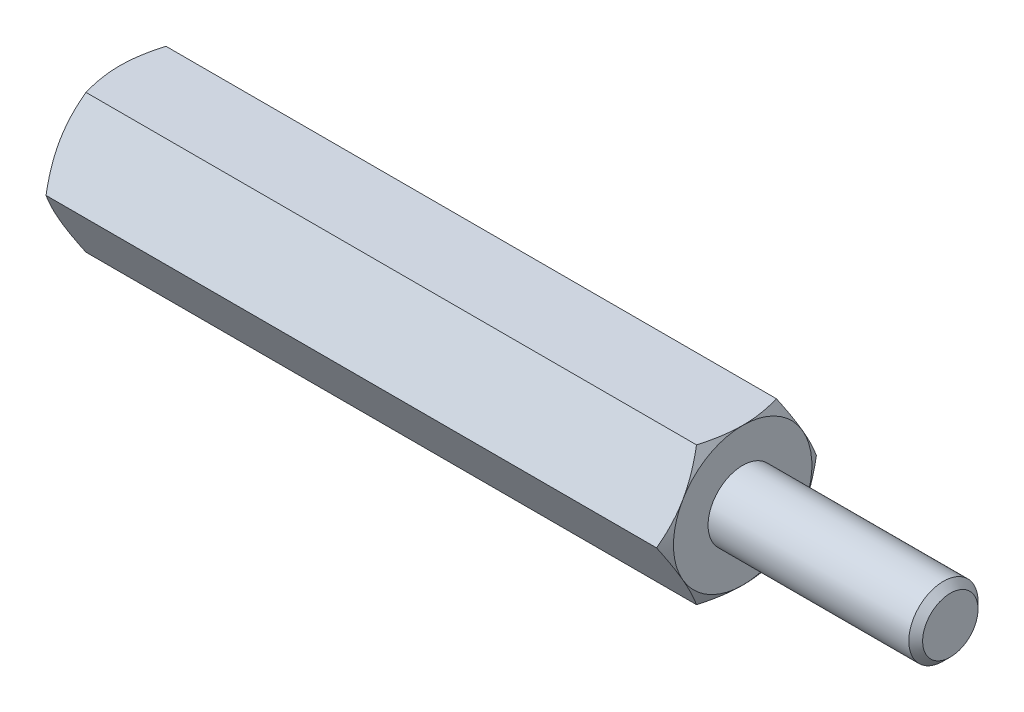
ISO-10303-21;
HEADER;
FILE_DESCRIPTION(('STEP AP214'),'2;1');
FILE_NAME('part.step','',(''),(''),'','','');
FILE_SCHEMA(('AUTOMOTIVE_DESIGN { 1 0 10303 214 1 1 1 1 }'));
ENDSEC;
DATA;
#1=APPLICATION_CONTEXT('core data for automotive mechanical design processes');
#2=APPLICATION_PROTOCOL_DEFINITION('international standard','automotive_design',2000,#1);
#3=PRODUCT_CONTEXT('',#1,'mechanical');
#4=PRODUCT('Part','Part','',(#3));
#5=PRODUCT_RELATED_PRODUCT_CATEGORY('part','',(#4));
#6=PRODUCT_DEFINITION_FORMATION('','',#4);
#7=PRODUCT_DEFINITION_CONTEXT('part definition',#1,'design');
#8=PRODUCT_DEFINITION('design','',#6,#7);
#9=PRODUCT_DEFINITION_SHAPE('','',#8);
#10=(LENGTH_UNIT() NAMED_UNIT(*) SI_UNIT(.MILLI.,.METRE.));
#11=(NAMED_UNIT(*) PLANE_ANGLE_UNIT() SI_UNIT($,.RADIAN.));
#12=(NAMED_UNIT(*) SI_UNIT($,.STERADIAN.) SOLID_ANGLE_UNIT());
#13=UNCERTAINTY_MEASURE_WITH_UNIT(LENGTH_MEASURE(1.E-05),#10,'distance_accuracy_value','');
#14=(GEOMETRIC_REPRESENTATION_CONTEXT(3) GLOBAL_UNCERTAINTY_ASSIGNED_CONTEXT((#13)) GLOBAL_UNIT_ASSIGNED_CONTEXT((#10,
#11,#12)) REPRESENTATION_CONTEXT('',''));
#15=CARTESIAN_POINT('',(0.,0.,0.));
#16=DIRECTION('',(0.,0.,1.));
#17=DIRECTION('',(1.,0.,0.));
#18=AXIS2_PLACEMENT_3D('',#15,#16,#17);
#19=CARTESIAN_POINT('',(9.,2.,-1.15470053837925));
#20=DIRECTION('',(1.,0.,0.));
#21=DIRECTION('',(0.,0.,-1.));
#22=AXIS2_PLACEMENT_3D('',#19,#20,#21);
#23=PLANE('',#22);
#24=CARTESIAN_POINT('',(9.,0.,0.));
#25=DIRECTION('',(1.,0.,0.));
#26=DIRECTION('',(0.,0.,-1.));
#27=AXIS2_PLACEMENT_3D('',#24,#25,#26);
#28=CIRCLE('',#27,2.);
#29=CARTESIAN_POINT('',(9.,-1.,-1.73205080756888));
#30=VERTEX_POINT('',#29);
#31=CARTESIAN_POINT('',(9.,0.999999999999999,-1.73205080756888));
#32=VERTEX_POINT('',#31);
#33=EDGE_CURVE('E288',#30,#32,#28,.T.);
#34=ORIENTED_EDGE('',*,*,#33,.T.);
#35=CARTESIAN_POINT('',(9.,2.,0.));
#36=VERTEX_POINT('',#35);
#37=EDGE_CURVE('E53',#32,#36,#28,.T.);
#38=ORIENTED_EDGE('',*,*,#37,.T.);
#39=CARTESIAN_POINT('',(9.,0.999999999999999,1.73205080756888));
#40=VERTEX_POINT('',#39);
#41=EDGE_CURVE('E295',#36,#40,#28,.T.);
#42=ORIENTED_EDGE('',*,*,#41,.T.);
#43=CARTESIAN_POINT('',(9.,-1.,1.73205080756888));
#44=VERTEX_POINT('',#43);
#45=EDGE_CURVE('E301',#40,#44,#28,.T.);
#46=ORIENTED_EDGE('',*,*,#45,.T.);
#47=CARTESIAN_POINT('',(9.,0.,0.));
#48=DIRECTION('',(-1.,0.,0.));
#49=DIRECTION('',(0.,-1.,0.));
#50=AXIS2_PLACEMENT_3D('',#47,#48,#49);
#51=CIRCLE('',#50,2.);
#52=CARTESIAN_POINT('',(9.,-2.,0.));
#53=VERTEX_POINT('',#52);
#54=EDGE_CURVE('E193',#53,#44,#51,.T.);
#55=ORIENTED_EDGE('',*,*,#54,.F.);
#56=EDGE_CURVE('E61',#53,#30,#28,.T.);
#57=ORIENTED_EDGE('',*,*,#56,.T.);
#58=EDGE_LOOP('',(#34,#38,#42,#46,#55,#57));
#59=FACE_BOUND('',#58,.T.);
#60=CARTESIAN_POINT('',(9.,0.,0.));
#61=DIRECTION('',(1.,0.,0.));
#62=DIRECTION('',(0.,0.,-1.));
#63=AXIS2_PLACEMENT_3D('',#60,#61,#62);
#64=CIRCLE('',#63,1.);
#65=CARTESIAN_POINT('',(9.,0.,-1.));
#66=VERTEX_POINT('',#65);
#67=EDGE_CURVE('E323',#66,#66,#64,.T.);
#68=ORIENTED_EDGE('',*,*,#67,.F.);
#69=EDGE_LOOP('',(#68));
#70=FACE_BOUND('',#69,.T.);
#71=ADVANCED_FACE('F37',(#59,#70),#23,.T.);
#72=CARTESIAN_POINT('',(9.,0.,-2.3094010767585));
#73=DIRECTION('',(0.,-0.5,0.866025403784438));
#74=DIRECTION('',(0.,-0.866025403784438,-0.5));
#75=AXIS2_PLACEMENT_3D('',#72,#73,#74);
#76=PLANE('',#75);
#77=CARTESIAN_POINT('',(8.8213005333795,-0.000200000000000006,-2.30951654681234));
#78=CARTESIAN_POINT('',(8.85061046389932,0.0876912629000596,-2.25877250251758));
#79=CARTESIAN_POINT('',(8.87726714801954,0.176341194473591,-2.20759044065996));
#80=CARTESIAN_POINT('',(8.92379750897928,0.355176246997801,-2.10433997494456));
#81=CARTESIAN_POINT('',(8.94365472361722,0.445364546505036,-2.05226973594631));
#82=CARTESIAN_POINT('',(8.97456653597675,0.624623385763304,-1.94877459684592));
#83=CARTESIAN_POINT('',(8.98582684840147,0.713666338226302,-1.89736562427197));
#84=CARTESIAN_POINT('',(8.99927133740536,0.892171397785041,-1.79430568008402));
#85=CARTESIAN_POINT('',(9.00146664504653,0.981632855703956,-1.74265508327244));
#86=CARTESIAN_POINT('',(8.99690901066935,1.1488083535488,-1.64613626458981));
#87=CARTESIAN_POINT('',(8.99127512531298,1.22654737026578,-1.60125362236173));
#88=CARTESIAN_POINT('',(8.97341610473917,1.38151891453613,-1.51178075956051));
#89=CARTESIAN_POINT('',(8.96118486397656,1.4587509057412,-1.46719084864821));
#90=CARTESIAN_POINT('',(8.93060656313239,1.6140421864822,-1.37753338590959));
#91=CARTESIAN_POINT('',(8.91212983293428,1.69208181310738,-1.33247718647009));
#92=CARTESIAN_POINT('',(8.87019448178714,1.84699686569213,-1.24303693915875));
#93=CARTESIAN_POINT('',(8.84674571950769,1.92387427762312,-1.1986517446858));
#94=CARTESIAN_POINT('',(8.8213005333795,2.0002,-1.15458506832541));
#95=B_SPLINE_CURVE_WITH_KNOTS('',3,(#77,#78,#79,#80,#81,#82,#83,#84,#85,#86,#87,#88,#89,#90,#91,
#92,#93,#94),.UNSPECIFIED.,.F.,.F.,(4,2,2,2,2,2,2,2,4),(0.,0.317031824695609,0.634825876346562,
0.944753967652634,1.25430138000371,1.52387047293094,1.79368946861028,2.06949491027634,
2.34475850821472),.UNSPECIFIED.);
#96=CARTESIAN_POINT('',(8.82136720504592,0.,-2.3094010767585));
#97=VERTEX_POINT('',#96);
#98=EDGE_CURVE('E321',#97,#32,#95,.T.);
#99=ORIENTED_EDGE('',*,*,#98,.F.);
#100=DIRECTION('',(-1.,0.,0.));
#101=VECTOR('',#100,1.);
#102=CARTESIAN_POINT('',(9.,0.,-2.3094010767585));
#103=LINE('',#102,#101);
#104=CARTESIAN_POINT('',(-8.82136720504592,0.,-2.3094010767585));
#105=VERTEX_POINT('',#104);
#106=EDGE_CURVE('E264',#97,#105,#103,.T.);
#107=ORIENTED_EDGE('',*,*,#106,.T.);
#108=CARTESIAN_POINT('',(-8.8213005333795,2.0002,-1.15458506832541));
#109=CARTESIAN_POINT('',(-8.85061046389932,1.91230873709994,-1.20532911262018));
#110=CARTESIAN_POINT('',(-8.87726714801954,1.82365880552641,-1.2565111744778));
#111=CARTESIAN_POINT('',(-8.92379750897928,1.6448237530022,-1.35976164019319));
#112=CARTESIAN_POINT('',(-8.94365472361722,1.55463545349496,-1.41183187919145));
#113=CARTESIAN_POINT('',(-8.97456653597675,1.37537661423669,-1.51532701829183));
#114=CARTESIAN_POINT('',(-8.98582684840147,1.2863336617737,-1.56673599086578));
#115=CARTESIAN_POINT('',(-8.99927133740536,1.10782860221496,-1.66979593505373));
#116=CARTESIAN_POINT('',(-9.00146664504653,1.01836714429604,-1.72144653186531));
#117=CARTESIAN_POINT('',(-8.99690901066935,0.851191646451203,-1.81796535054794));
#118=CARTESIAN_POINT('',(-8.99127512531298,0.773452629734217,-1.86284799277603));
#119=CARTESIAN_POINT('',(-8.97341610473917,0.618481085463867,-1.95232085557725));
#120=CARTESIAN_POINT('',(-8.96118486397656,0.541249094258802,-1.99691076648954));
#121=CARTESIAN_POINT('',(-8.93060656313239,0.3859578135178,-2.08656822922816));
#122=CARTESIAN_POINT('',(-8.91212983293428,0.307918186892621,-2.13162442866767));
#123=CARTESIAN_POINT('',(-8.87019448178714,0.153003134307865,-2.221064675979));
#124=CARTESIAN_POINT('',(-8.84674571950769,0.0761257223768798,-2.26544987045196));
#125=CARTESIAN_POINT('',(-8.8213005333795,-0.000200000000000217,-2.30951654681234));
#126=B_SPLINE_CURVE_WITH_KNOTS('',3,(#108,#109,#110,#111,#112,#113,#114,#115,#116,#117,#118,
#119,#120,#121,#122,#123,#124,#125),.UNSPECIFIED.,.F.,.F.,(4,2,2,2,2,2,2,2,4),(0.,
0.317031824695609,0.634825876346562,0.944753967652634,1.25430138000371,1.52387047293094,
1.79368946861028,2.06949491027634,2.34475850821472),.UNSPECIFIED.);
#127=CARTESIAN_POINT('',(-9.,0.999999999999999,-1.73205080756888));
#128=VERTEX_POINT('',#127);
#129=EDGE_CURVE('E314',#128,#105,#126,.T.);
#130=ORIENTED_EDGE('',*,*,#129,.F.);
#131=CARTESIAN_POINT('',(-8.82136720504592,2.,-1.15470053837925));
#132=VERTEX_POINT('',#131);
#133=EDGE_CURVE('E399',#132,#128,#126,.T.);
#134=ORIENTED_EDGE('',*,*,#133,.F.);
#135=DIRECTION('',(-1.,0.,0.));
#136=VECTOR('',#135,1.);
#137=CARTESIAN_POINT('',(9.,2.,-1.15470053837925));
#138=LINE('',#137,#136);
#139=CARTESIAN_POINT('',(8.821367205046,2.,-1.15470053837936));
#140=VERTEX_POINT('',#139);
#141=EDGE_CURVE('E279',#140,#132,#138,.T.);
#142=ORIENTED_EDGE('',*,*,#141,.F.);
#143=EDGE_CURVE('E229',#32,#140,#95,.T.);
#144=ORIENTED_EDGE('',*,*,#143,.F.);
#145=EDGE_LOOP('',(#99,#107,#130,#134,#142,#144));
#146=FACE_BOUND('',#145,.T.);
#147=ADVANCED_FACE('F148',(#146),#76,.F.);
#148=CARTESIAN_POINT('',(9.,2.,-1.15470053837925));
#149=DIRECTION('',(0.,-1.,0.));
#150=DIRECTION('',(0.,0.,-1.));
#151=AXIS2_PLACEMENT_3D('',#148,#149,#150);
#152=PLANE('',#151);
#153=CARTESIAN_POINT('',(8.0041453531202,2.,-3.14239762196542));
#154=CARTESIAN_POINT('',(8.04685680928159,2.,-3.05468337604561));
#155=CARTESIAN_POINT('',(8.08917030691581,2.,-2.96677207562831));
#156=CARTESIAN_POINT('',(8.17277831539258,2.,-2.79045070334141));
#157=CARTESIAN_POINT('',(8.21407267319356,2.,-2.70204055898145));
#158=CARTESIAN_POINT('',(8.29561838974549,2.,-2.52418069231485));
#159=CARTESIAN_POINT('',(8.33586319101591,2.,-2.43472795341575));
#160=CARTESIAN_POINT('',(8.41475904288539,2.,-2.25512498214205));
#161=CARTESIAN_POINT('',(8.45341016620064,2.,-2.16497478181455));
#162=CARTESIAN_POINT('',(8.52996617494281,2.,-1.98078525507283));
#163=CARTESIAN_POINT('',(8.56780217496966,2.,-1.88671714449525));
#164=CARTESIAN_POINT('',(8.64070044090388,2.,-1.69751412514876));
#165=CARTESIAN_POINT('',(8.67576294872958,2.,-1.60237931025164));
#166=CARTESIAN_POINT('',(8.74223535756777,2.,-1.41102905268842));
#167=CARTESIAN_POINT('',(8.77365196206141,2.,-1.31481596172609));
#168=CARTESIAN_POINT('',(8.83184764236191,2.,-1.12101028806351));
#169=CARTESIAN_POINT('',(8.8586281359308,2.,-1.02341813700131));
#170=CARTESIAN_POINT('',(8.90615162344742,2.,-0.827336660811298));
#171=CARTESIAN_POINT('',(8.9269281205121,2.,-0.728855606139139));
#172=CARTESIAN_POINT('',(8.96129559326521,2.,-0.530628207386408));
#173=CARTESIAN_POINT('',(8.97488733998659,2.,-0.430882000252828));
#174=CARTESIAN_POINT('',(8.99362159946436,2.,-0.231937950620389));
#175=CARTESIAN_POINT('',(8.99887592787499,2.,-0.132750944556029));
#176=CARTESIAN_POINT('',(9.00079968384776,2.,0.0657049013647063));
#177=CARTESIAN_POINT('',(8.9974689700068,2.,0.164973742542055));
#178=CARTESIAN_POINT('',(8.97965125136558,2.,0.4006926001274));
#179=CARTESIAN_POINT('',(8.96138848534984,2.,0.536859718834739));
#180=CARTESIAN_POINT('',(8.91179958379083,2.,0.806792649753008));
#181=CARTESIAN_POINT('',(8.88046153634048,2.,0.9405561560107));
#182=CARTESIAN_POINT('',(8.80733694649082,2.,1.20849227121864));
#183=CARTESIAN_POINT('',(8.76532316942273,2.,1.34260127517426));
#184=CARTESIAN_POINT('',(8.69701155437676,2.,1.54188460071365));
#185=CARTESIAN_POINT('',(8.67336125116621,2.,1.60799390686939));
#186=CARTESIAN_POINT('',(8.62457310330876,2.,1.73966131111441));
#187=CARTESIAN_POINT('',(8.59943529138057,2.,1.80521942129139));
#188=CARTESIAN_POINT('',(8.53045244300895,2.,1.98014362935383));
#189=CARTESIAN_POINT('',(8.48548288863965,2.,2.08906517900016));
#190=CARTESIAN_POINT('',(8.39293953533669,2.,2.3058004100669));
#191=CARTESIAN_POINT('',(8.34536546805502,2.,2.41361397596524));
#192=CARTESIAN_POINT('',(8.24822629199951,2.,2.62838132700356));
#193=CARTESIAN_POINT('',(8.19866051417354,2.,2.7353348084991));
#194=CARTESIAN_POINT('',(8.09800140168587,2.,2.94852186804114));
#195=CARTESIAN_POINT('',(8.04690802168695,2.,3.05475542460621));
#196=CARTESIAN_POINT('',(7.89169615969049,2.,3.37291303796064));
#197=CARTESIAN_POINT('',(7.78579652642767,2.,3.58396705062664));
#198=CARTESIAN_POINT('',(7.57100981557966,2.,4.00448363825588));
#199=CARTESIAN_POINT('',(7.46212334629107,2.,4.21394652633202));
#200=CARTESIAN_POINT('',(7.25376773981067,2.,4.61000648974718));
#201=CARTESIAN_POINT('',(7.15450073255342,2.,4.79671008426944));
#202=CARTESIAN_POINT('',(6.95476413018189,2.,5.16948614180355));
#203=CARTESIAN_POINT('',(6.85429446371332,2.,5.35555856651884));
#204=CARTESIAN_POINT('',(6.6527937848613,2.,5.72660635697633));
#205=CARTESIAN_POINT('',(6.55176570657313,2.,5.9115833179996));
#206=CARTESIAN_POINT('',(6.34902395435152,2.,6.28114276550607));
#207=CARTESIAN_POINT('',(6.24731033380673,2.,6.46572528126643));
#208=CARTESIAN_POINT('',(6.14534707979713,2.,6.65016883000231));
#209=B_SPLINE_CURVE_WITH_KNOTS('',3,(#153,#154,#155,#156,#157,#158,#159,#160,#161,#162,#163,
#164,#165,#166,#167,#168,#169,#170,#171,#172,#173,#174,#175,#176,#177,#178,#179,#180,#181,#182,
#183,#184,#185,#186,#187,#188,#189,#190,#191,#192,#193,#194,#195,#196,#197,#198,#199,#200,#201,
#202,#203,#204,#205,#206,#207,#208),.UNSPECIFIED.,.F.,.F.,(4,2,2,2,2,2,2,2,2,2,2,2,2,2,2,2,2,2,
2,2,2,2,2,2,2,2,2,4),(0.,0.29268498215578,0.585413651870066,0.879667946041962,1.17390879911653,
1.47805164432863,1.78216793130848,2.08571589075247,2.38917085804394,2.690898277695,
2.99259331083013,3.29020694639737,3.58782548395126,3.99913738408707,4.41082482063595,
4.83214112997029,5.0427662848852,5.25338680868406,5.60685637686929,5.96036243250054,
6.31398824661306,6.66762456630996,7.37597688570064,8.08418599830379,8.71853756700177,
9.3529269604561,9.98522933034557,10.6174830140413),.UNSPECIFIED.);
#210=EDGE_CURVE('E227',#140,#36,#209,.T.);
#211=ORIENTED_EDGE('',*,*,#210,.F.);
#212=ORIENTED_EDGE('',*,*,#141,.T.);
#213=CARTESIAN_POINT('',(-8.0041453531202,2.,-3.14239762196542));
#214=CARTESIAN_POINT('',(-8.04685680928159,2.,-3.05468337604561));
#215=CARTESIAN_POINT('',(-8.08917030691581,2.,-2.96677207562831));
#216=CARTESIAN_POINT('',(-8.17277831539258,2.,-2.79045070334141));
#217=CARTESIAN_POINT('',(-8.21407267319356,2.,-2.70204055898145));
#218=CARTESIAN_POINT('',(-8.29561838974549,2.,-2.52418069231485));
#219=CARTESIAN_POINT('',(-8.33586319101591,2.,-2.43472795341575));
#220=CARTESIAN_POINT('',(-8.41475904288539,2.,-2.25512498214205));
#221=CARTESIAN_POINT('',(-8.45341016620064,2.,-2.16497478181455));
#222=CARTESIAN_POINT('',(-8.52996617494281,2.,-1.98078525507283));
#223=CARTESIAN_POINT('',(-8.56780217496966,2.,-1.88671714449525));
#224=CARTESIAN_POINT('',(-8.64070044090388,2.,-1.69751412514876));
#225=CARTESIAN_POINT('',(-8.67576294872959,2.,-1.60237931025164));
#226=CARTESIAN_POINT('',(-8.74223535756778,2.,-1.41102905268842));
#227=CARTESIAN_POINT('',(-8.77365196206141,2.,-1.31481596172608));
#228=CARTESIAN_POINT('',(-8.83184764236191,2.,-1.12101028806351));
#229=CARTESIAN_POINT('',(-8.8586281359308,2.,-1.02341813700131));
#230=CARTESIAN_POINT('',(-8.90615162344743,2.,-0.827336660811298));
#231=CARTESIAN_POINT('',(-8.9269281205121,2.,-0.728855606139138));
#232=CARTESIAN_POINT('',(-8.96129559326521,2.,-0.530628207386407));
#233=CARTESIAN_POINT('',(-8.97488733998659,2.,-0.430882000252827));
#234=CARTESIAN_POINT('',(-8.99362159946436,2.,-0.231937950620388));
#235=CARTESIAN_POINT('',(-8.99887592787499,2.,-0.132750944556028));
#236=CARTESIAN_POINT('',(-9.00079968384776,2.,0.065704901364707));
#237=CARTESIAN_POINT('',(-8.9974689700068,2.,0.164973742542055));
#238=CARTESIAN_POINT('',(-8.97965125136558,2.,0.400692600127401));
#239=CARTESIAN_POINT('',(-8.96138848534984,2.,0.536859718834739));
#240=CARTESIAN_POINT('',(-8.91179958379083,2.,0.806792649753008));
#241=CARTESIAN_POINT('',(-8.88046153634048,2.,0.9405561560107));
#242=CARTESIAN_POINT('',(-8.80733694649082,2.,1.20849227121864));
#243=CARTESIAN_POINT('',(-8.76532316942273,2.,1.34260127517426));
#244=CARTESIAN_POINT('',(-8.69701155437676,2.,1.54188460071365));
#245=CARTESIAN_POINT('',(-8.67336125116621,2.,1.6079939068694));
#246=CARTESIAN_POINT('',(-8.62457310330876,2.,1.73966131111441));
#247=CARTESIAN_POINT('',(-8.59943529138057,2.,1.80521942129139));
#248=CARTESIAN_POINT('',(-8.53045244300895,2.,1.98014362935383));
#249=CARTESIAN_POINT('',(-8.48548288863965,2.,2.08906517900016));
#250=CARTESIAN_POINT('',(-8.39293953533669,2.,2.3058004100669));
#251=CARTESIAN_POINT('',(-8.34536546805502,2.,2.41361397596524));
#252=CARTESIAN_POINT('',(-8.2482262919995,2.,2.62838132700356));
#253=CARTESIAN_POINT('',(-8.19866051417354,2.,2.7353348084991));
#254=CARTESIAN_POINT('',(-8.09800140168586,2.,2.94852186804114));
#255=CARTESIAN_POINT('',(-8.04690802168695,2.,3.05475542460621));
#256=CARTESIAN_POINT('',(-7.89169615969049,2.,3.37291303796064));
#257=CARTESIAN_POINT('',(-7.78579652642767,2.,3.58396705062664));
#258=CARTESIAN_POINT('',(-7.57100981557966,2.,4.00448363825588));
#259=CARTESIAN_POINT('',(-7.46212334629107,2.,4.21394652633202));
#260=CARTESIAN_POINT('',(-7.25376773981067,2.,4.61000648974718));
#261=CARTESIAN_POINT('',(-7.15450073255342,2.,4.79671008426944));
#262=CARTESIAN_POINT('',(-6.95476413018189,2.,5.16948614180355));
#263=CARTESIAN_POINT('',(-6.85429446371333,2.,5.35555856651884));
#264=CARTESIAN_POINT('',(-6.6527937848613,2.,5.72660635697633));
#265=CARTESIAN_POINT('',(-6.55176570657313,2.,5.9115833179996));
#266=CARTESIAN_POINT('',(-6.34902395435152,2.,6.28114276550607));
#267=CARTESIAN_POINT('',(-6.24731033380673,2.,6.46572528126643));
#268=CARTESIAN_POINT('',(-6.14534707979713,2.,6.65016883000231));
#269=B_SPLINE_CURVE_WITH_KNOTS('',3,(#213,#214,#215,#216,#217,#218,#219,#220,#221,#222,#223,
#224,#225,#226,#227,#228,#229,#230,#231,#232,#233,#234,#235,#236,#237,#238,#239,#240,#241,#242,
#243,#244,#245,#246,#247,#248,#249,#250,#251,#252,#253,#254,#255,#256,#257,#258,#259,#260,#261,
#262,#263,#264,#265,#266,#267,#268),.UNSPECIFIED.,.F.,.F.,(4,2,2,2,2,2,2,2,2,2,2,2,2,2,2,2,2,2,
2,2,2,2,2,2,2,2,2,4),(0.,0.292684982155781,0.585413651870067,0.879667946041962,1.17390879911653,
1.47805164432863,1.78216793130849,2.08571589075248,2.38917085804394,2.690898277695,
2.99259331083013,3.29020694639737,3.58782548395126,3.99913738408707,4.41082482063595,
4.83214112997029,5.0427662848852,5.25338680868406,5.60685637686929,5.96036243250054,
6.31398824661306,6.66762456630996,7.37597688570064,8.08418599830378,8.71853756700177,
9.35292696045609,9.98522933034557,10.6174830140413),.UNSPECIFIED.);
#270=CARTESIAN_POINT('',(-9.,2.,0.));
#271=VERTEX_POINT('',#270);
#272=EDGE_CURVE('E241',#271,#132,#269,.F.);
#273=ORIENTED_EDGE('',*,*,#272,.F.);
#274=CARTESIAN_POINT('',(-8.82136720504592,2.,1.15470053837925));
#275=VERTEX_POINT('',#274);
#276=EDGE_CURVE('E249',#275,#271,#269,.F.);
#277=ORIENTED_EDGE('',*,*,#276,.F.);
#278=DIRECTION('',(-1.,0.,0.));
#279=VECTOR('',#278,1.);
#280=CARTESIAN_POINT('',(9.,2.,1.15470053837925));
#281=LINE('',#280,#279);
#282=CARTESIAN_POINT('',(8.82136720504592,2.,1.15470053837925));
#283=VERTEX_POINT('',#282);
#284=EDGE_CURVE('E276',#283,#275,#281,.T.);
#285=ORIENTED_EDGE('',*,*,#284,.F.);
#286=EDGE_CURVE('E221',#36,#283,#209,.T.);
#287=ORIENTED_EDGE('',*,*,#286,.F.);
#288=EDGE_LOOP('',(#211,#212,#273,#277,#285,#287));
#289=FACE_BOUND('',#288,.T.);
#290=ADVANCED_FACE('F153',(#289),#152,.F.);
#291=CARTESIAN_POINT('',(9.,2.,1.15470053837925));
#292=DIRECTION('',(0.,-0.5,-0.866025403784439));
#293=DIRECTION('',(0.,0.866025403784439,-0.5));
#294=AXIS2_PLACEMENT_3D('',#291,#292,#293);
#295=PLANE('',#294);
#296=CARTESIAN_POINT('',(8.8213005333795,2.0002,1.15458506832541));
#297=CARTESIAN_POINT('',(8.85061046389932,1.91230873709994,1.20532911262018));
#298=CARTESIAN_POINT('',(8.87726714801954,1.82365880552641,1.2565111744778));
#299=CARTESIAN_POINT('',(8.92379750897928,1.6448237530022,1.35976164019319));
#300=CARTESIAN_POINT('',(8.94365472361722,1.55463545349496,1.41183187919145));
#301=CARTESIAN_POINT('',(8.97456653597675,1.37537661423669,1.51532701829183));
#302=CARTESIAN_POINT('',(8.98582684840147,1.2863336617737,1.56673599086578));
#303=CARTESIAN_POINT('',(8.99927133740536,1.10782860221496,1.66979593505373));
#304=CARTESIAN_POINT('',(9.00146664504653,1.01836714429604,1.72144653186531));
#305=CARTESIAN_POINT('',(8.99690901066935,0.851191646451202,1.81796535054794));
#306=CARTESIAN_POINT('',(8.99127512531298,0.773452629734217,1.86284799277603));
#307=CARTESIAN_POINT('',(8.97341610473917,0.618481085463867,1.95232085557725));
#308=CARTESIAN_POINT('',(8.96118486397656,0.541249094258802,1.99691076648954));
#309=CARTESIAN_POINT('',(8.93060656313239,0.3859578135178,2.08656822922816));
#310=CARTESIAN_POINT('',(8.91212983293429,0.307918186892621,2.13162442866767));
#311=CARTESIAN_POINT('',(8.87019448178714,0.153003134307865,2.221064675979));
#312=CARTESIAN_POINT('',(8.84674571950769,0.0761257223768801,2.26544987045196));
#313=CARTESIAN_POINT('',(8.8213005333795,-0.000199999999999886,2.30951654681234));
#314=B_SPLINE_CURVE_WITH_KNOTS('',3,(#296,#297,#298,#299,#300,#301,#302,#303,#304,#305,#306,
#307,#308,#309,#310,#311,#312,#313),.UNSPECIFIED.,.F.,.F.,(4,2,2,2,2,2,2,2,4),(0.,
0.31703182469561,0.634825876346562,0.944753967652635,1.25430138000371,1.52387047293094,
1.79368946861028,2.06949491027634,2.34475850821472),.UNSPECIFIED.);
#315=EDGE_CURVE('E228',#283,#40,#314,.T.);
#316=ORIENTED_EDGE('',*,*,#315,.F.);
#317=ORIENTED_EDGE('',*,*,#284,.T.);
#318=CARTESIAN_POINT('',(-8.8213005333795,-0.000199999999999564,2.30951654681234));
#319=CARTESIAN_POINT('',(-8.85061046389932,0.08769126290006,2.25877250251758));
#320=CARTESIAN_POINT('',(-8.87726714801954,0.176341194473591,2.20759044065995));
#321=CARTESIAN_POINT('',(-8.92379750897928,0.355176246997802,2.10433997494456));
#322=CARTESIAN_POINT('',(-8.94365472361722,0.445364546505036,2.0522697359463));
#323=CARTESIAN_POINT('',(-8.97456653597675,0.624623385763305,1.94877459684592));
#324=CARTESIAN_POINT('',(-8.98582684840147,0.713666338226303,1.89736562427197));
#325=CARTESIAN_POINT('',(-8.99927133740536,0.892171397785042,1.79430568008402));
#326=CARTESIAN_POINT('',(-9.00146664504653,0.981632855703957,1.74265508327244));
#327=CARTESIAN_POINT('',(-8.99690901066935,1.1488083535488,1.64613626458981));
#328=CARTESIAN_POINT('',(-8.99127512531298,1.22654737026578,1.60125362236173));
#329=CARTESIAN_POINT('',(-8.97341610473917,1.38151891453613,1.51178075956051));
#330=CARTESIAN_POINT('',(-8.96118486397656,1.4587509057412,1.46719084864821));
#331=CARTESIAN_POINT('',(-8.93060656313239,1.6140421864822,1.37753338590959));
#332=CARTESIAN_POINT('',(-8.91212983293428,1.69208181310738,1.33247718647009));
#333=CARTESIAN_POINT('',(-8.87019448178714,1.84699686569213,1.24303693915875));
#334=CARTESIAN_POINT('',(-8.84674571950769,1.92387427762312,1.1986517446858));
#335=CARTESIAN_POINT('',(-8.8213005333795,2.0002,1.15458506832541));
#336=B_SPLINE_CURVE_WITH_KNOTS('',3,(#318,#319,#320,#321,#322,#323,#324,#325,#326,#327,#328,
#329,#330,#331,#332,#333,#334,#335),.UNSPECIFIED.,.F.,.F.,(4,2,2,2,2,2,2,2,4),(0.,
0.317031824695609,0.634825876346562,0.944753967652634,1.25430138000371,1.52387047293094,
1.79368946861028,2.06949491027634,2.34475850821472),.UNSPECIFIED.);
#337=CARTESIAN_POINT('',(-9.,0.999999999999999,1.73205080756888));
#338=VERTEX_POINT('',#337);
#339=EDGE_CURVE('E255',#338,#275,#336,.T.);
#340=ORIENTED_EDGE('',*,*,#339,.F.);
#341=CARTESIAN_POINT('',(-8.82136720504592,0.,2.3094010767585));
#342=VERTEX_POINT('',#341);
#343=EDGE_CURVE('E262',#342,#338,#336,.T.);
#344=ORIENTED_EDGE('',*,*,#343,.F.);
#345=DIRECTION('',(-1.,0.,0.));
#346=VECTOR('',#345,1.);
#347=CARTESIAN_POINT('',(9.,0.,2.3094010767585));
#348=LINE('',#347,#346);
#349=CARTESIAN_POINT('',(8.82136720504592,0.,2.3094010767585));
#350=VERTEX_POINT('',#349);
#351=EDGE_CURVE('E273',#350,#342,#348,.T.);
#352=ORIENTED_EDGE('',*,*,#351,.F.);
#353=EDGE_CURVE('E215',#40,#350,#314,.T.);
#354=ORIENTED_EDGE('',*,*,#353,.F.);
#355=EDGE_LOOP('',(#316,#317,#340,#344,#352,#354));
#356=FACE_BOUND('',#355,.T.);
#357=ADVANCED_FACE('F235',(#356),#295,.F.);
#358=CARTESIAN_POINT('',(9.,0.,2.3094010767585));
#359=DIRECTION('',(0.,0.5,-0.866025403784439));
#360=DIRECTION('',(0.,0.866025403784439,0.5));
#361=AXIS2_PLACEMENT_3D('',#358,#359,#360);
#362=PLANE('',#361);
#363=CARTESIAN_POINT('',(8.8213005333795,0.000200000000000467,2.30951654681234));
#364=CARTESIAN_POINT('',(8.85061046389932,-0.0876912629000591,2.25877250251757));
#365=CARTESIAN_POINT('',(8.87726714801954,-0.17634119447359,2.20759044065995));
#366=CARTESIAN_POINT('',(8.92379750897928,-0.355176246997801,2.10433997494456));
#367=CARTESIAN_POINT('',(8.94365472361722,-0.445364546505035,2.0522697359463));
#368=CARTESIAN_POINT('',(8.97456653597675,-0.624623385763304,1.94877459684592));
#369=CARTESIAN_POINT('',(8.98582684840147,-0.713666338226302,1.89736562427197));
#370=CARTESIAN_POINT('',(8.99927133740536,-0.892171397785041,1.79430568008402));
#371=CARTESIAN_POINT('',(9.00146664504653,-0.981632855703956,1.74265508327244));
#372=CARTESIAN_POINT('',(8.99690901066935,-1.1488083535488,1.64613626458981));
#373=CARTESIAN_POINT('',(8.99127512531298,-1.22654737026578,1.60125362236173));
#374=CARTESIAN_POINT('',(8.97341610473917,-1.38151891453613,1.51178075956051));
#375=CARTESIAN_POINT('',(8.96118486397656,-1.4587509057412,1.46719084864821));
#376=CARTESIAN_POINT('',(8.93060656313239,-1.6140421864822,1.37753338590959));
#377=CARTESIAN_POINT('',(8.91212983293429,-1.69208181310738,1.33247718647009));
#378=CARTESIAN_POINT('',(8.87019448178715,-1.84699686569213,1.24303693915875));
#379=CARTESIAN_POINT('',(8.84674571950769,-1.92387427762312,1.1986517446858));
#380=CARTESIAN_POINT('',(8.8213005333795,-2.0002,1.15458506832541));
#381=B_SPLINE_CURVE_WITH_KNOTS('',3,(#363,#364,#365,#366,#367,#368,#369,#370,#371,#372,#373,
#374,#375,#376,#377,#378,#379,#380),.UNSPECIFIED.,.F.,.F.,(4,2,2,2,2,2,2,2,4),(0.,
0.317031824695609,0.634825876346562,0.944753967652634,1.25430138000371,1.52387047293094,
1.79368946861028,2.06949491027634,2.34475850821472),.UNSPECIFIED.);
#382=EDGE_CURVE('E374',#350,#44,#381,.T.);
#383=ORIENTED_EDGE('',*,*,#382,.F.);
#384=ORIENTED_EDGE('',*,*,#351,.T.);
#385=CARTESIAN_POINT('',(-8.8213005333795,-2.0002,1.15458506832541));
#386=CARTESIAN_POINT('',(-8.85061046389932,-1.91230873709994,1.20532911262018));
#387=CARTESIAN_POINT('',(-8.87726714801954,-1.82365880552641,1.2565111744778));
#388=CARTESIAN_POINT('',(-8.92379750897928,-1.6448237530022,1.35976164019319));
#389=CARTESIAN_POINT('',(-8.94365472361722,-1.55463545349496,1.41183187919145));
#390=CARTESIAN_POINT('',(-8.97456653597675,-1.3753766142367,1.51532701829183));
#391=CARTESIAN_POINT('',(-8.98582684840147,-1.2863336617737,1.56673599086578));
#392=CARTESIAN_POINT('',(-8.99927133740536,-1.10782860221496,1.66979593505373));
#393=CARTESIAN_POINT('',(-9.00146664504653,-1.01836714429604,1.72144653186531));
#394=CARTESIAN_POINT('',(-8.99690901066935,-0.851191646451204,1.81796535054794));
#395=CARTESIAN_POINT('',(-8.99127512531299,-0.773452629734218,1.86284799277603));
#396=CARTESIAN_POINT('',(-8.97341610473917,-0.618481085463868,1.95232085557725));
#397=CARTESIAN_POINT('',(-8.96118486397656,-0.541249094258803,1.99691076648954));
#398=CARTESIAN_POINT('',(-8.93060656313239,-0.3859578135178,2.08656822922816));
#399=CARTESIAN_POINT('',(-8.91212983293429,-0.307918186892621,2.13162442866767));
#400=CARTESIAN_POINT('',(-8.87019448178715,-0.153003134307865,2.221064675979));
#401=CARTESIAN_POINT('',(-8.84674571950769,-0.0761257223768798,2.26544987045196));
#402=CARTESIAN_POINT('',(-8.8213005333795,0.000200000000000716,2.30951654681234));
#403=B_SPLINE_CURVE_WITH_KNOTS('',3,(#385,#386,#387,#388,#389,#390,#391,#392,#393,#394,#395,
#396,#397,#398,#399,#400,#401,#402),.UNSPECIFIED.,.F.,.F.,(4,2,2,2,2,2,2,2,4),(0.,
0.317031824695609,0.634825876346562,0.944753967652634,1.25430138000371,1.52387047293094,
1.79368946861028,2.06949491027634,2.34475850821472),.UNSPECIFIED.);
#404=CARTESIAN_POINT('',(-9.,-1.,1.73205080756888));
#405=VERTEX_POINT('',#404);
#406=EDGE_CURVE('E263',#405,#342,#403,.T.);
#407=ORIENTED_EDGE('',*,*,#406,.F.);
#408=CARTESIAN_POINT('',(-8.82136720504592,-2.,1.15470053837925));
#409=VERTEX_POINT('',#408);
#410=EDGE_CURVE('E250',#409,#405,#403,.T.);
#411=ORIENTED_EDGE('',*,*,#410,.F.);
#412=DIRECTION('',(-1.,0.,0.));
#413=VECTOR('',#412,1.);
#414=CARTESIAN_POINT('',(9.,-2.,1.15470053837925));
#415=LINE('',#414,#413);
#416=CARTESIAN_POINT('',(8.82136720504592,-2.,1.15470053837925));
#417=VERTEX_POINT('',#416);
#418=EDGE_CURVE('E270',#417,#409,#415,.T.);
#419=ORIENTED_EDGE('',*,*,#418,.F.);
#420=EDGE_CURVE('E210',#44,#417,#381,.T.);
#421=ORIENTED_EDGE('',*,*,#420,.F.);
#422=EDGE_LOOP('',(#383,#384,#407,#411,#419,#421));
#423=FACE_BOUND('',#422,.T.);
#424=ADVANCED_FACE('F389',(#423),#362,.F.);
#425=CARTESIAN_POINT('',(9.,-2.,1.15470053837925));
#426=DIRECTION('',(0.,1.,0.));
#427=DIRECTION('',(0.,0.,1.));
#428=AXIS2_PLACEMENT_3D('',#425,#426,#427);
#429=PLANE('',#428);
#430=CARTESIAN_POINT('',(8.0041453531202,-2.,-3.14239762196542));
#431=CARTESIAN_POINT('',(8.04685680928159,-2.,-3.05468337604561));
#432=CARTESIAN_POINT('',(8.08917030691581,-2.,-2.96677207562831));
#433=CARTESIAN_POINT('',(8.17277831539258,-2.,-2.79045070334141));
#434=CARTESIAN_POINT('',(8.21407267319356,-2.,-2.70204055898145));
#435=CARTESIAN_POINT('',(8.29561838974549,-2.,-2.52418069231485));
#436=CARTESIAN_POINT('',(8.33586319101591,-2.,-2.43472795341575));
#437=CARTESIAN_POINT('',(8.41475904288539,-2.,-2.25512498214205));
#438=CARTESIAN_POINT('',(8.45341016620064,-2.,-2.16497478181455));
#439=CARTESIAN_POINT('',(8.52996617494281,-2.,-1.98078525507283));
#440=CARTESIAN_POINT('',(8.56780217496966,-2.,-1.88671714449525));
#441=CARTESIAN_POINT('',(8.64070044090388,-2.,-1.69751412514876));
#442=CARTESIAN_POINT('',(8.67576294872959,-2.,-1.60237931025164));
#443=CARTESIAN_POINT('',(8.74223535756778,-2.,-1.41102905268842));
#444=CARTESIAN_POINT('',(8.77365196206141,-2.,-1.31481596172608));
#445=CARTESIAN_POINT('',(8.83184764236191,-2.,-1.12101028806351));
#446=CARTESIAN_POINT('',(8.8586281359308,-2.,-1.02341813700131));
#447=CARTESIAN_POINT('',(8.90615162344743,-2.,-0.8273366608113));
#448=CARTESIAN_POINT('',(8.9269281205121,-2.,-0.72885560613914));
#449=CARTESIAN_POINT('',(8.96129559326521,-2.,-0.530628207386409));
#450=CARTESIAN_POINT('',(8.97488733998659,-2.,-0.430882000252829));
#451=CARTESIAN_POINT('',(8.99362159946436,-2.,-0.23193795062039));
#452=CARTESIAN_POINT('',(8.99887592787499,-2.,-0.13275094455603));
#453=CARTESIAN_POINT('',(9.00079968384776,-2.,0.0657049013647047));
#454=CARTESIAN_POINT('',(8.9974689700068,-2.,0.164973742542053));
#455=CARTESIAN_POINT('',(8.97965125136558,-2.,0.400692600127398));
#456=CARTESIAN_POINT('',(8.96138848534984,-2.,0.536859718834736));
#457=CARTESIAN_POINT('',(8.91179958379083,-2.,0.806792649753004));
#458=CARTESIAN_POINT('',(8.88046153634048,-2.,0.940556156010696));
#459=CARTESIAN_POINT('',(8.80733694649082,-2.,1.20849227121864));
#460=CARTESIAN_POINT('',(8.76532316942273,-2.,1.34260127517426));
#461=CARTESIAN_POINT('',(8.69701155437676,-2.,1.54188460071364));
#462=CARTESIAN_POINT('',(8.67336125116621,-2.,1.60799390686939));
#463=CARTESIAN_POINT('',(8.62457310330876,-2.,1.7396613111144));
#464=CARTESIAN_POINT('',(8.59943529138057,-2.,1.80521942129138));
#465=CARTESIAN_POINT('',(8.53045244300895,-2.,1.98014362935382));
#466=CARTESIAN_POINT('',(8.48548288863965,-2.,2.08906517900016));
#467=CARTESIAN_POINT('',(8.3929395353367,-2.,2.30580041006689));
#468=CARTESIAN_POINT('',(8.34536546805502,-2.,2.41361397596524));
#469=CARTESIAN_POINT('',(8.24822629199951,-2.,2.62838132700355));
#470=CARTESIAN_POINT('',(8.19866051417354,-2.,2.7353348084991));
#471=CARTESIAN_POINT('',(8.09800140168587,-2.,2.94852186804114));
#472=CARTESIAN_POINT('',(8.04690802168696,-2.,3.05475542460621));
#473=CARTESIAN_POINT('',(7.89169615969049,-2.,3.37291303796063));
#474=CARTESIAN_POINT('',(7.78579652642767,-2.,3.58396705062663));
#475=CARTESIAN_POINT('',(7.57100981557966,-2.,4.00448363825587));
#476=CARTESIAN_POINT('',(7.46212334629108,-2.,4.21394652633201));
#477=CARTESIAN_POINT('',(7.25376773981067,-2.,4.61000648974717));
#478=CARTESIAN_POINT('',(7.15450073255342,-2.,4.79671008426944));
#479=CARTESIAN_POINT('',(6.9547641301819,-2.,5.16948614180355));
#480=CARTESIAN_POINT('',(6.85429446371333,-2.,5.35555856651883));
#481=CARTESIAN_POINT('',(6.6527937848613,-2.,5.72660635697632));
#482=CARTESIAN_POINT('',(6.55176570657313,-2.,5.9115833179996));
#483=CARTESIAN_POINT('',(6.34902395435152,-2.,6.28114276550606));
#484=CARTESIAN_POINT('',(6.24731033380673,-2.,6.46572528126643));
#485=CARTESIAN_POINT('',(6.14534707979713,-2.,6.6501688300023));
#486=B_SPLINE_CURVE_WITH_KNOTS('',3,(#430,#431,#432,#433,#434,#435,#436,#437,#438,#439,#440,
#441,#442,#443,#444,#445,#446,#447,#448,#449,#450,#451,#452,#453,#454,#455,#456,#457,#458,#459,
#460,#461,#462,#463,#464,#465,#466,#467,#468,#469,#470,#471,#472,#473,#474,#475,#476,#477,#478,
#479,#480,#481,#482,#483,#484,#485),.UNSPECIFIED.,.F.,.F.,(4,2,2,2,2,2,2,2,2,2,2,2,2,2,2,2,2,2,
2,2,2,2,2,2,2,2,2,4),(0.,0.292684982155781,0.585413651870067,0.879667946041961,1.17390879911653,
1.47805164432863,1.78216793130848,2.08571589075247,2.38917085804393,2.69089827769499,
2.99259331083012,3.29020694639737,3.58782548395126,3.99913738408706,4.41082482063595,
4.83214112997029,5.04276628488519,5.25338680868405,5.60685637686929,5.96036243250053,
6.31398824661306,6.66762456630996,7.37597688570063,8.08418599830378,8.71853756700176,
9.35292696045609,9.98522933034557,10.6174830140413),.UNSPECIFIED.);
#487=EDGE_CURVE('E343',#417,#53,#486,.F.);
#488=ORIENTED_EDGE('',*,*,#487,.F.);
#489=ORIENTED_EDGE('',*,*,#418,.T.);
#490=CARTESIAN_POINT('',(-8.0041453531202,-2.,-3.14239762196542));
#491=CARTESIAN_POINT('',(-8.04685680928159,-2.,-3.05468337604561));
#492=CARTESIAN_POINT('',(-8.08917030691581,-2.,-2.96677207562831));
#493=CARTESIAN_POINT('',(-8.17277831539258,-2.,-2.79045070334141));
#494=CARTESIAN_POINT('',(-8.21407267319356,-2.,-2.70204055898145));
#495=CARTESIAN_POINT('',(-8.29561838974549,-2.,-2.52418069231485));
#496=CARTESIAN_POINT('',(-8.33586319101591,-2.,-2.43472795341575));
#497=CARTESIAN_POINT('',(-8.41475904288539,-2.,-2.25512498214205));
#498=CARTESIAN_POINT('',(-8.45341016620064,-2.,-2.16497478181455));
#499=CARTESIAN_POINT('',(-8.52996617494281,-2.,-1.98078525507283));
#500=CARTESIAN_POINT('',(-8.56780217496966,-2.,-1.88671714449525));
#501=CARTESIAN_POINT('',(-8.64070044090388,-2.,-1.69751412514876));
#502=CARTESIAN_POINT('',(-8.67576294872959,-2.,-1.60237931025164));
#503=CARTESIAN_POINT('',(-8.74223535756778,-2.,-1.41102905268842));
#504=CARTESIAN_POINT('',(-8.77365196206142,-2.,-1.31481596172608));
#505=CARTESIAN_POINT('',(-8.83184764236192,-2.,-1.12101028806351));
#506=CARTESIAN_POINT('',(-8.8586281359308,-2.,-1.02341813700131));
#507=CARTESIAN_POINT('',(-8.90615162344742,-2.,-0.827336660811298));
#508=CARTESIAN_POINT('',(-8.9269281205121,-2.,-0.728855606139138));
#509=CARTESIAN_POINT('',(-8.96129559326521,-2.,-0.530628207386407));
#510=CARTESIAN_POINT('',(-8.97488733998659,-2.,-0.430882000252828));
#511=CARTESIAN_POINT('',(-8.99362159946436,-2.,-0.231937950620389));
#512=CARTESIAN_POINT('',(-8.99887592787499,-2.,-0.132750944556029));
#513=CARTESIAN_POINT('',(-9.00079968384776,-2.,0.0657049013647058));
#514=CARTESIAN_POINT('',(-8.9974689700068,-2.,0.164973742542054));
#515=CARTESIAN_POINT('',(-8.97965125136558,-2.,0.400692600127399));
#516=CARTESIAN_POINT('',(-8.96138848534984,-2.,0.536859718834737));
#517=CARTESIAN_POINT('',(-8.91179958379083,-2.,0.806792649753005));
#518=CARTESIAN_POINT('',(-8.88046153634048,-2.,0.940556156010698));
#519=CARTESIAN_POINT('',(-8.80733694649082,-2.,1.20849227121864));
#520=CARTESIAN_POINT('',(-8.76532316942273,-2.,1.34260127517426));
#521=CARTESIAN_POINT('',(-8.69701155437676,-2.,1.54188460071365));
#522=CARTESIAN_POINT('',(-8.67336125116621,-2.,1.60799390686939));
#523=CARTESIAN_POINT('',(-8.62457310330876,-2.,1.7396613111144));
#524=CARTESIAN_POINT('',(-8.59943529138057,-2.,1.80521942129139));
#525=CARTESIAN_POINT('',(-8.53045244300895,-2.,1.98014362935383));
#526=CARTESIAN_POINT('',(-8.48548288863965,-2.,2.08906517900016));
#527=CARTESIAN_POINT('',(-8.3929395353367,-2.,2.3058004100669));
#528=CARTESIAN_POINT('',(-8.34536546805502,-2.,2.41361397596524));
#529=CARTESIAN_POINT('',(-8.24822629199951,-2.,2.62838132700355));
#530=CARTESIAN_POINT('',(-8.19866051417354,-2.,2.7353348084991));
#531=CARTESIAN_POINT('',(-8.09800140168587,-2.,2.94852186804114));
#532=CARTESIAN_POINT('',(-8.04690802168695,-2.,3.05475542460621));
#533=CARTESIAN_POINT('',(-7.89169615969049,-2.,3.37291303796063));
#534=CARTESIAN_POINT('',(-7.78579652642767,-2.,3.58396705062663));
#535=CARTESIAN_POINT('',(-7.57100981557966,-2.,4.00448363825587));
#536=CARTESIAN_POINT('',(-7.46212334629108,-2.,4.21394652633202));
#537=CARTESIAN_POINT('',(-7.25376773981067,-2.,4.61000648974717));
#538=CARTESIAN_POINT('',(-7.15450073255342,-2.,4.79671008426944));
#539=CARTESIAN_POINT('',(-6.9547641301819,-2.,5.16948614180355));
#540=CARTESIAN_POINT('',(-6.85429446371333,-2.,5.35555856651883));
#541=CARTESIAN_POINT('',(-6.6527937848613,-2.,5.72660635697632));
#542=CARTESIAN_POINT('',(-6.55176570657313,-2.,5.9115833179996));
#543=CARTESIAN_POINT('',(-6.34902395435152,-2.,6.28114276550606));
#544=CARTESIAN_POINT('',(-6.24731033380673,-2.,6.46572528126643));
#545=CARTESIAN_POINT('',(-6.14534707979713,-2.,6.6501688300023));
#546=B_SPLINE_CURVE_WITH_KNOTS('',3,(#490,#491,#492,#493,#494,#495,#496,#497,#498,#499,#500,
#501,#502,#503,#504,#505,#506,#507,#508,#509,#510,#511,#512,#513,#514,#515,#516,#517,#518,#519,
#520,#521,#522,#523,#524,#525,#526,#527,#528,#529,#530,#531,#532,#533,#534,#535,#536,#537,#538,
#539,#540,#541,#542,#543,#544,#545),.UNSPECIFIED.,.F.,.F.,(4,2,2,2,2,2,2,2,2,2,2,2,2,2,2,2,2,2,
2,2,2,2,2,2,2,2,2,4),(0.,0.292684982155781,0.585413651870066,0.879667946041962,1.17390879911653,
1.47805164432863,1.78216793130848,2.08571589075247,2.38917085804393,2.69089827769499,
2.99259331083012,3.29020694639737,3.58782548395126,3.99913738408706,4.41082482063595,
4.83214112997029,5.04276628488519,5.25338680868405,5.60685637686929,5.96036243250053,
6.31398824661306,6.66762456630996,7.37597688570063,8.08418599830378,8.71853756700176,
9.35292696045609,9.98522933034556,10.6174830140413),.UNSPECIFIED.);
#547=CARTESIAN_POINT('',(-9.,-2.,0.));
#548=VERTEX_POINT('',#547);
#549=EDGE_CURVE('E381',#548,#409,#546,.T.);
#550=ORIENTED_EDGE('',*,*,#549,.F.);
#551=CARTESIAN_POINT('',(-8.82136720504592,-2.,-1.15470053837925));
#552=VERTEX_POINT('',#551);
#553=EDGE_CURVE('E380',#552,#548,#546,.T.);
#554=ORIENTED_EDGE('',*,*,#553,.F.);
#555=DIRECTION('',(-1.,0.,0.));
#556=VECTOR('',#555,1.);
#557=CARTESIAN_POINT('',(9.,-2.,-1.15470053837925));
#558=LINE('',#557,#556);
#559=CARTESIAN_POINT('',(8.82136720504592,-2.,-1.15470053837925));
#560=VERTEX_POINT('',#559);
#561=EDGE_CURVE('E267',#560,#552,#558,.T.);
#562=ORIENTED_EDGE('',*,*,#561,.F.);
#563=EDGE_CURVE('E195',#53,#560,#486,.F.);
#564=ORIENTED_EDGE('',*,*,#563,.F.);
#565=EDGE_LOOP('',(#488,#489,#550,#554,#562,#564));
#566=FACE_BOUND('',#565,.T.);
#567=ADVANCED_FACE('F172',(#566),#429,.F.);
#568=CARTESIAN_POINT('',(9.,-2.,-1.15470053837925));
#569=DIRECTION('',(0.,0.5,0.866025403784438));
#570=DIRECTION('',(0.,-0.866025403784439,0.5));
#571=AXIS2_PLACEMENT_3D('',#568,#569,#570);
#572=PLANE('',#571);
#573=CARTESIAN_POINT('',(8.8213005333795,-2.0002,-1.15458506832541));
#574=CARTESIAN_POINT('',(8.85061046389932,-1.91230873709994,-1.20532911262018));
#575=CARTESIAN_POINT('',(8.87726714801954,-1.82365880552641,-1.2565111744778));
#576=CARTESIAN_POINT('',(8.92379750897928,-1.6448237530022,-1.35976164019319));
#577=CARTESIAN_POINT('',(8.94365472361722,-1.55463545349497,-1.41183187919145));
#578=CARTESIAN_POINT('',(8.97456653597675,-1.3753766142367,-1.51532701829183));
#579=CARTESIAN_POINT('',(8.98582684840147,-1.2863336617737,-1.56673599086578));
#580=CARTESIAN_POINT('',(8.99927133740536,-1.10782860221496,-1.66979593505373));
#581=CARTESIAN_POINT('',(9.00146664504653,-1.01836714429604,-1.72144653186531));
#582=CARTESIAN_POINT('',(8.99690901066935,-0.851191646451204,-1.81796535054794));
#583=CARTESIAN_POINT('',(8.99127512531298,-0.773452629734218,-1.86284799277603));
#584=CARTESIAN_POINT('',(8.97341610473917,-0.618481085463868,-1.95232085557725));
#585=CARTESIAN_POINT('',(8.96118486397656,-0.541249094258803,-1.99691076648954));
#586=CARTESIAN_POINT('',(8.93060656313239,-0.3859578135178,-2.08656822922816));
#587=CARTESIAN_POINT('',(8.91212983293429,-0.307918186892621,-2.13162442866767));
#588=CARTESIAN_POINT('',(8.87019448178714,-0.153003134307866,-2.221064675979));
#589=CARTESIAN_POINT('',(8.84674571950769,-0.0761257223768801,-2.26544987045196));
#590=CARTESIAN_POINT('',(8.8213005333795,0.000200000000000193,-2.30951654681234));
#591=B_SPLINE_CURVE_WITH_KNOTS('',3,(#573,#574,#575,#576,#577,#578,#579,#580,#581,#582,#583,
#584,#585,#586,#587,#588,#589,#590),.UNSPECIFIED.,.F.,.F.,(4,2,2,2,2,2,2,2,4),(0.,
0.317031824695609,0.634825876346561,0.944753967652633,1.25430138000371,1.52387047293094,
1.79368946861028,2.06949491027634,2.34475850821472),.UNSPECIFIED.);
#592=EDGE_CURVE('E192',#560,#30,#591,.T.);
#593=ORIENTED_EDGE('',*,*,#592,.F.);
#594=ORIENTED_EDGE('',*,*,#561,.T.);
#595=CARTESIAN_POINT('',(-8.8213005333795,0.000199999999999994,-2.30951654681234));
#596=CARTESIAN_POINT('',(-8.85061046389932,-0.0876912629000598,-2.25877250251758));
#597=CARTESIAN_POINT('',(-8.87726714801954,-0.176341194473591,-2.20759044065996));
#598=CARTESIAN_POINT('',(-8.92379750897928,-0.355176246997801,-2.10433997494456));
#599=CARTESIAN_POINT('',(-8.94365472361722,-0.445364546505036,-2.05226973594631));
#600=CARTESIAN_POINT('',(-8.97456653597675,-0.624623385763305,-1.94877459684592));
#601=CARTESIAN_POINT('',(-8.98582684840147,-0.713666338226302,-1.89736562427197));
#602=CARTESIAN_POINT('',(-8.99927133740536,-0.892171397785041,-1.79430568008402));
#603=CARTESIAN_POINT('',(-9.00146664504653,-0.981632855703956,-1.74265508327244));
#604=CARTESIAN_POINT('',(-8.99690901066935,-1.1488083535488,-1.64613626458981));
#605=CARTESIAN_POINT('',(-8.99127512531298,-1.22654737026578,-1.60125362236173));
#606=CARTESIAN_POINT('',(-8.97341610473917,-1.38151891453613,-1.51178075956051));
#607=CARTESIAN_POINT('',(-8.96118486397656,-1.4587509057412,-1.46719084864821));
#608=CARTESIAN_POINT('',(-8.93060656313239,-1.6140421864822,-1.37753338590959));
#609=CARTESIAN_POINT('',(-8.91212983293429,-1.69208181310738,-1.33247718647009));
#610=CARTESIAN_POINT('',(-8.87019448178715,-1.84699686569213,-1.24303693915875));
#611=CARTESIAN_POINT('',(-8.84674571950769,-1.92387427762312,-1.1986517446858));
#612=CARTESIAN_POINT('',(-8.8213005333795,-2.0002,-1.15458506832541));
#613=B_SPLINE_CURVE_WITH_KNOTS('',3,(#595,#596,#597,#598,#599,#600,#601,#602,#603,#604,#605,
#606,#607,#608,#609,#610,#611,#612),.UNSPECIFIED.,.F.,.F.,(4,2,2,2,2,2,2,2,4),(0.,
0.317031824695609,0.634825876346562,0.944753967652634,1.25430138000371,1.52387047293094,
1.79368946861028,2.06949491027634,2.34475850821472),.UNSPECIFIED.);
#614=CARTESIAN_POINT('',(-9.,-1.,-1.73205080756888));
#615=VERTEX_POINT('',#614);
#616=EDGE_CURVE('E178',#615,#552,#613,.T.);
#617=ORIENTED_EDGE('',*,*,#616,.F.);
#618=EDGE_CURVE('E379',#105,#615,#613,.T.);
#619=ORIENTED_EDGE('',*,*,#618,.F.);
#620=ORIENTED_EDGE('',*,*,#106,.F.);
#621=EDGE_CURVE('E185',#30,#97,#591,.T.);
#622=ORIENTED_EDGE('',*,*,#621,.F.);
#623=EDGE_LOOP('',(#593,#594,#617,#619,#620,#622));
#624=FACE_BOUND('',#623,.T.);
#625=ADVANCED_FACE('F167',(#624),#572,.F.);
#626=CARTESIAN_POINT('',(-9.,0.,0.));
#627=DIRECTION('',(1.,0.,0.));
#628=DIRECTION('',(0.,1.,0.));
#629=AXIS2_PLACEMENT_3D('',#626,#627,#628);
#630=CONICAL_SURFACE('',#629,2.,1.0471975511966);
#631=ORIENTED_EDGE('',*,*,#129,.T.);
#632=ORIENTED_EDGE('',*,*,#618,.T.);
#633=CARTESIAN_POINT('',(-9.,0.,0.));
#634=DIRECTION('',(1.,0.,0.));
#635=DIRECTION('',(0.,0.,-1.));
#636=AXIS2_PLACEMENT_3D('',#633,#634,#635);
#637=CIRCLE('',#636,2.);
#638=EDGE_CURVE('E282',#615,#128,#637,.T.);
#639=ORIENTED_EDGE('',*,*,#638,.T.);
#640=EDGE_LOOP('',(#631,#632,#639));
#641=FACE_BOUND('',#640,.T.);
#642=ADVANCED_FACE('F171',(#641),#630,.T.);
#643=ORIENTED_EDGE('',*,*,#553,.T.);
#644=EDGE_CURVE('E286',#548,#615,#637,.T.);
#645=ORIENTED_EDGE('',*,*,#644,.T.);
#646=ORIENTED_EDGE('',*,*,#616,.T.);
#647=EDGE_LOOP('',(#643,#645,#646));
#648=FACE_BOUND('',#647,.T.);
#649=ADVANCED_FACE('F406',(#648),#630,.T.);
#650=ORIENTED_EDGE('',*,*,#410,.T.);
#651=CARTESIAN_POINT('',(-9.,0.,0.));
#652=DIRECTION('',(-1.,0.,0.));
#653=DIRECTION('',(0.,-1.,0.));
#654=AXIS2_PLACEMENT_3D('',#651,#652,#653);
#655=CIRCLE('',#654,2.);
#656=EDGE_CURVE('E322',#548,#405,#655,.T.);
#657=ORIENTED_EDGE('',*,*,#656,.F.);
#658=ORIENTED_EDGE('',*,*,#549,.T.);
#659=EDGE_LOOP('',(#650,#657,#658));
#660=FACE_BOUND('',#659,.T.);
#661=ADVANCED_FACE('F414',(#660),#630,.T.);
#662=ORIENTED_EDGE('',*,*,#343,.T.);
#663=EDGE_CURVE('E316',#338,#405,#637,.T.);
#664=ORIENTED_EDGE('',*,*,#663,.T.);
#665=ORIENTED_EDGE('',*,*,#406,.T.);
#666=EDGE_LOOP('',(#662,#664,#665));
#667=FACE_BOUND('',#666,.T.);
#668=ADVANCED_FACE('F158',(#667),#630,.T.);
#669=ORIENTED_EDGE('',*,*,#339,.T.);
#670=ORIENTED_EDGE('',*,*,#276,.T.);
#671=EDGE_CURVE('E318',#271,#338,#637,.T.);
#672=ORIENTED_EDGE('',*,*,#671,.T.);
#673=EDGE_LOOP('',(#669,#670,#672));
#674=FACE_BOUND('',#673,.T.);
#675=ADVANCED_FACE('F428',(#674),#630,.T.);
#676=ORIENTED_EDGE('',*,*,#272,.T.);
#677=ORIENTED_EDGE('',*,*,#133,.T.);
#678=EDGE_CURVE('E287',#128,#271,#637,.T.);
#679=ORIENTED_EDGE('',*,*,#678,.T.);
#680=EDGE_LOOP('',(#676,#677,#679));
#681=FACE_BOUND('',#680,.T.);
#682=ADVANCED_FACE('F165',(#681),#630,.T.);
#683=CARTESIAN_POINT('',(-9.,2.,-1.15470053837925));
#684=DIRECTION('',(1.,0.,0.));
#685=DIRECTION('',(0.,0.,-1.));
#686=AXIS2_PLACEMENT_3D('',#683,#684,#685);
#687=PLANE('',#686);
#688=CARTESIAN_POINT('',(-9.,0.,0.));
#689=DIRECTION('',(-1.,0.,0.));
#690=DIRECTION('',(0.,0.,1.));
#691=AXIS2_PLACEMENT_3D('',#688,#689,#690);
#692=CIRCLE('',#691,0.8);
#693=CARTESIAN_POINT('',(-9.,0.,0.8));
#694=VERTEX_POINT('',#693);
#695=EDGE_CURVE('E331',#694,#694,#692,.T.);
#696=ORIENTED_EDGE('',*,*,#695,.F.);
#697=EDGE_LOOP('',(#696));
#698=FACE_BOUND('',#697,.T.);
#699=ORIENTED_EDGE('',*,*,#678,.F.);
#700=ORIENTED_EDGE('',*,*,#638,.F.);
#701=ORIENTED_EDGE('',*,*,#644,.F.);
#702=ORIENTED_EDGE('',*,*,#656,.T.);
#703=ORIENTED_EDGE('',*,*,#663,.F.);
#704=ORIENTED_EDGE('',*,*,#671,.F.);
#705=EDGE_LOOP('',(#699,#700,#701,#702,#703,#704));
#706=FACE_BOUND('',#705,.T.);
#707=ADVANCED_FACE('F161',(#698,#706),#687,.F.);
#708=CARTESIAN_POINT('',(9.,0.,0.));
#709=DIRECTION('',(-1.,0.,0.));
#710=DIRECTION('',(0.,1.,0.));
#711=AXIS2_PLACEMENT_3D('',#708,#709,#710);
#712=CONICAL_SURFACE('',#711,2.,1.0471975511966);
#713=ORIENTED_EDGE('',*,*,#98,.T.);
#714=ORIENTED_EDGE('',*,*,#33,.F.);
#715=ORIENTED_EDGE('',*,*,#621,.T.);
#716=EDGE_LOOP('',(#713,#714,#715));
#717=FACE_BOUND('',#716,.T.);
#718=ADVANCED_FACE('F164',(#717),#712,.T.);
#719=ORIENTED_EDGE('',*,*,#563,.T.);
#720=ORIENTED_EDGE('',*,*,#592,.T.);
#721=ORIENTED_EDGE('',*,*,#56,.F.);
#722=EDGE_LOOP('',(#719,#720,#721));
#723=FACE_BOUND('',#722,.T.);
#724=ADVANCED_FACE('F202',(#723),#712,.T.);
#725=ORIENTED_EDGE('',*,*,#420,.T.);
#726=ORIENTED_EDGE('',*,*,#487,.T.);
#727=ORIENTED_EDGE('',*,*,#54,.T.);
#728=EDGE_LOOP('',(#725,#726,#727));
#729=FACE_BOUND('',#728,.T.);
#730=ADVANCED_FACE('F341',(#729),#712,.T.);
#731=ORIENTED_EDGE('',*,*,#353,.T.);
#732=ORIENTED_EDGE('',*,*,#382,.T.);
#733=ORIENTED_EDGE('',*,*,#45,.F.);
#734=EDGE_LOOP('',(#731,#732,#733));
#735=FACE_BOUND('',#734,.T.);
#736=ADVANCED_FACE('F384',(#735),#712,.T.);
#737=ORIENTED_EDGE('',*,*,#286,.T.);
#738=ORIENTED_EDGE('',*,*,#315,.T.);
#739=ORIENTED_EDGE('',*,*,#41,.F.);
#740=EDGE_LOOP('',(#737,#738,#739));
#741=FACE_BOUND('',#740,.T.);
#742=ADVANCED_FACE('F495',(#741),#712,.T.);
#743=ORIENTED_EDGE('',*,*,#143,.T.);
#744=ORIENTED_EDGE('',*,*,#210,.T.);
#745=ORIENTED_EDGE('',*,*,#37,.F.);
#746=EDGE_LOOP('',(#743,#744,#745));
#747=FACE_BOUND('',#746,.T.);
#748=ADVANCED_FACE('F143',(#747),#712,.T.);
#749=CARTESIAN_POINT('',(-3.,0.,0.));
#750=DIRECTION('',(-1.,0.,0.));
#751=DIRECTION('',(0.,0.,1.));
#752=AXIS2_PLACEMENT_3D('',#749,#750,#751);
#753=CYLINDRICAL_SURFACE('',#752,0.8);
#754=CARTESIAN_POINT('',(-3.,0.,0.));
#755=DIRECTION('',(1.,0.,0.));
#756=DIRECTION('',(0.,1.,0.));
#757=AXIS2_PLACEMENT_3D('',#754,#755,#756);
#758=CIRCLE('',#757,0.799999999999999);
#759=CARTESIAN_POINT('',(-3.,0.8,0.));
#760=VERTEX_POINT('',#759);
#761=EDGE_CURVE('E325',#760,#760,#758,.T.);
#762=ORIENTED_EDGE('',*,*,#761,.T.);
#763=EDGE_LOOP('',(#762));
#764=FACE_BOUND('',#763,.T.);
#765=ORIENTED_EDGE('',*,*,#695,.T.);
#766=EDGE_LOOP('',(#765));
#767=FACE_BOUND('',#766,.T.);
#768=ADVANCED_FACE('F133',(#764,#767),#753,.F.);
#769=CARTESIAN_POINT('',(-2.5381197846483,0.,0.));
#770=DIRECTION('',(-1.,0.,0.));
#771=DIRECTION('',(0.,-1.,0.));
#772=AXIS2_PLACEMENT_3D('',#769,#770,#771);
#773=CONICAL_SURFACE('',#772,0.,1.0471975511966);
#774=ORIENTED_EDGE('',*,*,#761,.F.);
#775=EDGE_LOOP('',(#774));
#776=FACE_BOUND('',#775,.T.);
#777=CARTESIAN_POINT('',(-2.5381197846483,0.,0.));
#778=VERTEX_POINT('',#777);
#779=VERTEX_LOOP('',#778);
#780=FACE_BOUND('',#779,.T.);
#781=ADVANCED_FACE('F130',(#776,#780),#773,.F.);
#782=CARTESIAN_POINT('',(15.,0.,0.));
#783=DIRECTION('',(-1.,0.,0.));
#784=DIRECTION('',(0.,0.,1.));
#785=AXIS2_PLACEMENT_3D('',#782,#783,#784);
#786=CYLINDRICAL_SURFACE('',#785,1.);
#787=CARTESIAN_POINT('',(14.8,0.,0.));
#788=DIRECTION('',(1.,0.,0.));
#789=DIRECTION('',(0.,0.,-1.));
#790=AXIS2_PLACEMENT_3D('',#787,#788,#789);
#791=CIRCLE('',#790,1.);
#792=CARTESIAN_POINT('',(14.8,0.,-1.));
#793=VERTEX_POINT('',#792);
#794=EDGE_CURVE('E11',#793,#793,#791,.F.);
#795=ORIENTED_EDGE('',*,*,#794,.T.);
#796=EDGE_LOOP('',(#795));
#797=FACE_BOUND('',#796,.T.);
#798=ORIENTED_EDGE('',*,*,#67,.T.);
#799=EDGE_LOOP('',(#798));
#800=FACE_BOUND('',#799,.T.);
#801=ADVANCED_FACE('F132',(#797,#800),#786,.T.);
#802=CARTESIAN_POINT('',(15.,0.,0.));
#803=DIRECTION('',(1.,0.,0.));
#804=DIRECTION('',(0.,0.,-1.));
#805=AXIS2_PLACEMENT_3D('',#802,#803,#804);
#806=PLANE('',#805);
#807=CARTESIAN_POINT('',(15.,0.,0.));
#808=DIRECTION('',(1.,0.,0.));
#809=DIRECTION('',(0.,0.,-1.));
#810=AXIS2_PLACEMENT_3D('',#807,#808,#809);
#811=CIRCLE('',#810,0.800000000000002);
#812=CARTESIAN_POINT('',(15.,0.,-0.800000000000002));
#813=VERTEX_POINT('',#812);
#814=EDGE_CURVE('E46',#813,#813,#811,.T.);
#815=ORIENTED_EDGE('',*,*,#814,.T.);
#816=EDGE_LOOP('',(#815));
#817=FACE_BOUND('',#816,.T.);
#818=ADVANCED_FACE('F140',(#817),#806,.T.);
#819=CARTESIAN_POINT('',(15.,0.,0.));
#820=DIRECTION('',(-1.,0.,0.));
#821=DIRECTION('',(0.,0.,1.));
#822=AXIS2_PLACEMENT_3D('',#819,#820,#821);
#823=CONICAL_SURFACE('',#822,0.800000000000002,0.785398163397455);
#824=ORIENTED_EDGE('',*,*,#794,.F.);
#825=EDGE_LOOP('',(#824));
#826=FACE_BOUND('',#825,.T.);
#827=ORIENTED_EDGE('',*,*,#814,.F.);
#828=EDGE_LOOP('',(#827));
#829=FACE_BOUND('',#828,.T.);
#830=ADVANCED_FACE('F39',(#826,#829),#823,.T.);
#831=CLOSED_SHELL('',(#71,#147,#290,#357,#424,#567,#625,#642,#649,#661,#668,#675,#682,#707,#718,
#724,#730,#736,#742,#748,#768,#781,#801,#818,#830));
#832=MANIFOLD_SOLID_BREP('B2',#831);
#833=ADVANCED_BREP_SHAPE_REPRESENTATION('',(#18,#832),#14);
#834=SHAPE_DEFINITION_REPRESENTATION(#9,#833);
ENDSEC;
END-ISO-10303-21;
